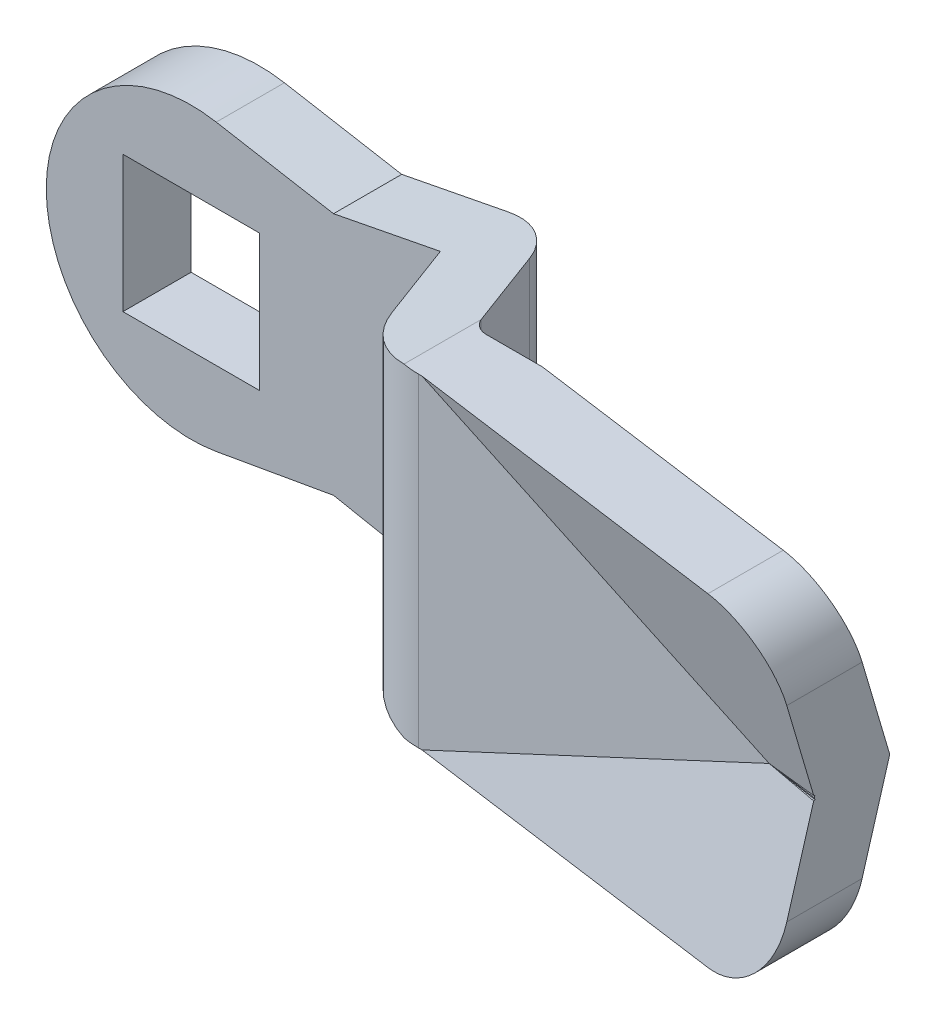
ISO-10303-21;
HEADER;
FILE_DESCRIPTION(('STEP AP214'),'2;1');
FILE_NAME('part.step','',(''),(''),'','','');
FILE_SCHEMA(('AUTOMOTIVE_DESIGN { 1 0 10303 214 1 1 1 1 }'));
ENDSEC;
DATA;
#1=APPLICATION_CONTEXT('core data for automotive mechanical design processes');
#2=APPLICATION_PROTOCOL_DEFINITION('international standard','automotive_design',2000,#1);
#3=PRODUCT_CONTEXT('',#1,'mechanical');
#4=PRODUCT('Part','Part','',(#3));
#5=PRODUCT_RELATED_PRODUCT_CATEGORY('part','',(#4));
#6=PRODUCT_DEFINITION_FORMATION('','',#4);
#7=PRODUCT_DEFINITION_CONTEXT('part definition',#1,'design');
#8=PRODUCT_DEFINITION('design','',#6,#7);
#9=PRODUCT_DEFINITION_SHAPE('','',#8);
#10=(LENGTH_UNIT() NAMED_UNIT(*) SI_UNIT(.MILLI.,.METRE.));
#11=(NAMED_UNIT(*) PLANE_ANGLE_UNIT() SI_UNIT($,.RADIAN.));
#12=(NAMED_UNIT(*) SI_UNIT($,.STERADIAN.) SOLID_ANGLE_UNIT());
#13=UNCERTAINTY_MEASURE_WITH_UNIT(LENGTH_MEASURE(1.E-05),#10,'distance_accuracy_value','');
#14=(GEOMETRIC_REPRESENTATION_CONTEXT(3) GLOBAL_UNCERTAINTY_ASSIGNED_CONTEXT((#13)) GLOBAL_UNIT_ASSIGNED_CONTEXT((#10,
#11,#12)) REPRESENTATION_CONTEXT('',''));
#15=CARTESIAN_POINT('',(0.,0.,0.));
#16=DIRECTION('',(0.,0.,1.));
#17=DIRECTION('',(1.,0.,0.));
#18=AXIS2_PLACEMENT_3D('',#15,#16,#17);
#19=CARTESIAN_POINT('',(49.9633750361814,-17.238998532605,18.1803398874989));
#20=DIRECTION('',(0.130596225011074,-0.280064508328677,-0.951056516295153));
#21=DIRECTION('',(0.,-0.959272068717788,0.282483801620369));
#22=AXIS2_PLACEMENT_3D('',#19,#20,#21);
#23=PLANE('',#22);
#24=DIRECTION('',(-0.990703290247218,0.,-0.13604040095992));
#25=VECTOR('',#24,1.);
#26=CARTESIAN_POINT('',(50.2705232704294,-9.5,15.9435575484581));
#27=LINE('',#26,#25);
#28=CARTESIAN_POINT('',(41.,-9.5,14.6705571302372));
#29=VERTEX_POINT('',#28);
#30=CARTESIAN_POINT('',(21.5518822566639,-9.5,12.));
#31=VERTEX_POINT('',#30);
#32=EDGE_CURVE('E378',#29,#31,#27,.T.);
#33=ORIENTED_EDGE('',*,*,#32,.F.);
#34=CARTESIAN_POINT('',(41.,-5.5,13.4926481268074));
#35=DIRECTION('',(0.130596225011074,-0.280064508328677,-0.951056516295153));
#36=DIRECTION('',(0.401933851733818,-0.861949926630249,0.309016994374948));
#37=AXIS2_PLACEMENT_3D('',#34,#35,#36);
#38=ELLIPSE('',#37,4.20584889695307,4.);
#39=CARTESIAN_POINT('',(45.,-5.5,14.0419161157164));
#40=VERTEX_POINT('',#39);
#41=EDGE_CURVE('E9',#29,#40,#38,.F.);
#42=ORIENTED_EDGE('',*,*,#41,.T.);
#43=DIRECTION('',(0.,0.959272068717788,-0.28248380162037));
#44=VECTOR('',#43,1.);
#45=CARTESIAN_POINT('',(45.,-17.4236857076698,17.5531703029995));
#46=LINE('',#45,#44);
#47=CARTESIAN_POINT('',(45.,-0.136162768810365,12.4623880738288));
#48=VERTEX_POINT('',#47);
#49=EDGE_CURVE('E372',#40,#48,#46,.T.);
#50=ORIENTED_EDGE('',*,*,#49,.T.);
#51=DIRECTION('',(0.987938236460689,-0.0437421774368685,0.148541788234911));
#52=VECTOR('',#51,1.);
#53=CARTESIAN_POINT('',(51.4225647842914,-0.420529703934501,13.4280549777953));
#54=LINE('',#53,#52);
#55=CARTESIAN_POINT('',(41.924698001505,0.,12.));
#56=VERTEX_POINT('',#55);
#57=EDGE_CURVE('E218',#56,#48,#54,.T.);
#58=ORIENTED_EDGE('',*,*,#57,.F.);
#59=DIRECTION('',(0.906307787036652,0.422618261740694,0.));
#60=VECTOR('',#59,1.);
#61=CARTESIAN_POINT('',(40.8120209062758,-0.518849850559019,12.));
#62=LINE('',#61,#60);
#63=EDGE_CURVE('E394',#56,#31,#62,.F.);
#64=ORIENTED_EDGE('',*,*,#63,.T.);
#65=EDGE_LOOP('',(#33,#42,#50,#58,#64));
#66=FACE_BOUND('',#65,.T.);
#67=ADVANCED_FACE('F14',(#66),#23,.F.);
#68=DIRECTION('',(-0.990703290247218,0.,-0.13604040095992));
#69=VECTOR('',#68,1.);
#70=CARTESIAN_POINT('',(50.6475627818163,0.,13.1977975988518));
#71=LINE('',#70,#69);
#72=CARTESIAN_POINT('',(45.,0.,12.4222912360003));
#73=VERTEX_POINT('',#72);
#74=EDGE_CURVE('E227',#73,#56,#71,.T.);
#75=ORIENTED_EDGE('',*,*,#74,.F.);
#76=CARTESIAN_POINT('',(45.,0.114431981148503,12.3885936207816));
#77=VERTEX_POINT('',#76);
#78=EDGE_CURVE('E234',#73,#77,#46,.T.);
#79=ORIENTED_EDGE('',*,*,#78,.T.);
#80=DIRECTION('',(0.991435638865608,0.0368913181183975,0.125277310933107));
#81=VECTOR('',#80,1.);
#82=CARTESIAN_POINT('',(41.924698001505,0.,12.));
#83=LINE('',#82,#81);
#84=EDGE_CURVE('E239',#56,#77,#83,.T.);
#85=ORIENTED_EDGE('',*,*,#84,.F.);
#86=EDGE_LOOP('',(#75,#79,#85));
#87=FACE_BOUND('',#86,.T.);
#88=ADVANCED_FACE('F536',(#87),#23,.F.);
#89=CARTESIAN_POINT('',(45.,-40.,40.));
#90=DIRECTION('',(-1.,0.,0.));
#91=DIRECTION('',(0.,1.,0.));
#92=AXIS2_PLACEMENT_3D('',#89,#90,#91);
#93=PLANE('',#92);
#94=DIRECTION('',(0.,-0.959272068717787,-0.282483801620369));
#95=VECTOR('',#94,1.);
#96=CARTESIAN_POINT('',(45.,11.3997764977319,11.3569748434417));
#97=LINE('',#96,#95);
#98=CARTESIAN_POINT('',(45.,5.5,9.61962487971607));
#99=VERTEX_POINT('',#98);
#100=CARTESIAN_POINT('',(45.,0.,8.));
#101=VERTEX_POINT('',#100);
#102=EDGE_CURVE('E374',#99,#101,#97,.T.);
#103=ORIENTED_EDGE('',*,*,#102,.F.);
#104=DIRECTION('',(0.,0.,-1.));
#105=VECTOR('',#104,1.);
#106=CARTESIAN_POINT('',(45.,5.5,40.));
#107=LINE('',#106,#105);
#108=CARTESIAN_POINT('',(45.,5.5,14.0419161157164));
#109=VERTEX_POINT('',#108);
#110=EDGE_CURVE('E458',#99,#109,#107,.F.);
#111=ORIENTED_EDGE('',*,*,#110,.T.);
#112=DIRECTION('',(0.,0.959272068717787,0.282483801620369));
#113=VECTOR('',#112,1.);
#114=CARTESIAN_POINT('',(45.,20.0272720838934,18.3198672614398));
#115=LINE('',#114,#113);
#116=CARTESIAN_POINT('',(45.,0.136162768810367,12.4623880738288));
#117=VERTEX_POINT('',#116);
#118=EDGE_CURVE('E369',#117,#109,#115,.T.);
#119=ORIENTED_EDGE('',*,*,#118,.F.);
#120=DIRECTION('',(0.,-0.28248380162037,-0.959272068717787));
#121=VECTOR('',#120,1.);
#122=CARTESIAN_POINT('',(45.,4.39552305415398,26.9265284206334));
#123=LINE('',#122,#121);
#124=EDGE_CURVE('E445',#117,#77,#123,.T.);
#125=ORIENTED_EDGE('',*,*,#124,.T.);
#126=ORIENTED_EDGE('',*,*,#78,.F.);
#127=DIRECTION('',(0.,0.959272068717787,0.28248380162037));
#128=VECTOR('',#127,1.);
#129=CARTESIAN_POINT('',(45.,-29.3351410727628,3.78375953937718));
#130=LINE('',#129,#128);
#131=CARTESIAN_POINT('',(45.,-0.114431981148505,12.3885936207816));
#132=VERTEX_POINT('',#131);
#133=EDGE_CURVE('E222',#132,#73,#130,.T.);
#134=ORIENTED_EDGE('',*,*,#133,.F.);
#135=DIRECTION('',(0.,0.282483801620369,-0.959272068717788));
#136=VECTOR('',#135,1.);
#137=CARTESIAN_POINT('',(45.,-10.7792909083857,48.6048340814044));
#138=LINE('',#137,#136);
#139=EDGE_CURVE('E212',#48,#132,#138,.T.);
#140=ORIENTED_EDGE('',*,*,#139,.F.);
#141=ORIENTED_EDGE('',*,*,#49,.F.);
#142=DIRECTION('',(0.,0.,-1.));
#143=VECTOR('',#142,1.);
#144=CARTESIAN_POINT('',(45.,-5.5,40.));
#145=LINE('',#144,#143);
#146=CARTESIAN_POINT('',(45.,-5.5,9.61962487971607));
#147=VERTEX_POINT('',#146);
#148=EDGE_CURVE('E455',#40,#147,#145,.T.);
#149=ORIENTED_EDGE('',*,*,#148,.T.);
#150=DIRECTION('',(0.,-0.959272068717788,0.28248380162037));
#151=VECTOR('',#150,1.);
#152=CARTESIAN_POINT('',(45.,-26.2800452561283,15.7388754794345));
#153=LINE('',#152,#151);
#154=EDGE_CURVE('E376',#101,#147,#153,.T.);
#155=ORIENTED_EDGE('',*,*,#154,.F.);
#156=EDGE_LOOP('',(#103,#111,#119,#125,#126,#134,#140,#141,#149,#155));
#157=FACE_BOUND('',#156,.T.);
#158=ADVANCED_FACE('F232',(#157),#93,.F.);
#159=CARTESIAN_POINT('',(41.2717168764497,1.40032254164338,16.7552825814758));
#160=DIRECTION('',(0.,0.959272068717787,-0.28248380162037));
#161=DIRECTION('',(0.,-0.28248380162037,-0.959272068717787));
#162=AXIS2_PLACEMENT_3D('',#159,#160,#161);
#163=PLANE('',#162);
#164=DIRECTION('',(0.987938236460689,0.0437421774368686,0.148541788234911));
#165=VECTOR('',#164,1.);
#166=CARTESIAN_POINT('',(42.0457266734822,0.00535869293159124,12.018197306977));
#167=LINE('',#166,#165);
#168=EDGE_CURVE('E447',#56,#117,#167,.T.);
#169=ORIENTED_EDGE('',*,*,#168,.F.);
#170=ORIENTED_EDGE('',*,*,#84,.T.);
#171=ORIENTED_EDGE('',*,*,#124,.F.);
#172=EDGE_LOOP('',(#169,#170,#171));
#173=FACE_BOUND('',#172,.T.);
#174=ADVANCED_FACE('F534',(#173),#163,.F.);
#175=CARTESIAN_POINT('',(10.5,-2.8,-2.4));
#176=DIRECTION('',(1.,0.,0.));
#177=DIRECTION('',(0.,0.,1.));
#178=AXIS2_PLACEMENT_3D('',#175,#176,#177);
#179=PLANE('',#178);
#180=DIRECTION('',(0.,0.,1.));
#181=VECTOR('',#180,1.);
#182=CARTESIAN_POINT('',(10.5,-2.8,-2.4));
#183=LINE('',#182,#181);
#184=CARTESIAN_POINT('',(10.5,-2.8,-0.400000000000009));
#185=VERTEX_POINT('',#184);
#186=CARTESIAN_POINT('',(10.5,-2.8,0.));
#187=VERTEX_POINT('',#186);
#188=EDGE_CURVE('E279',#185,#187,#183,.T.);
#189=ORIENTED_EDGE('',*,*,#188,.F.);
#190=DIRECTION('',(0.,-1.,0.));
#191=VECTOR('',#190,1.);
#192=CARTESIAN_POINT('',(10.5,9.5,-0.400000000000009));
#193=LINE('',#192,#191);
#194=CARTESIAN_POINT('',(10.5,2.8,-0.400000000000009));
#195=VERTEX_POINT('',#194);
#196=EDGE_CURVE('E245',#195,#185,#193,.T.);
#197=ORIENTED_EDGE('',*,*,#196,.F.);
#198=DIRECTION('',(0.,0.,1.));
#199=VECTOR('',#198,1.);
#200=CARTESIAN_POINT('',(10.5,2.8,-2.4));
#201=LINE('',#200,#199);
#202=CARTESIAN_POINT('',(10.5,2.8,0.));
#203=VERTEX_POINT('',#202);
#204=EDGE_CURVE('E271',#195,#203,#201,.T.);
#205=ORIENTED_EDGE('',*,*,#204,.T.);
#206=DIRECTION('',(0.,1.,0.));
#207=VECTOR('',#206,1.);
#208=CARTESIAN_POINT('',(10.5,-2.8,0.));
#209=LINE('',#208,#207);
#210=EDGE_CURVE('E252',#187,#203,#209,.T.);
#211=ORIENTED_EDGE('',*,*,#210,.F.);
#212=EDGE_LOOP('',(#189,#197,#205,#211));
#213=FACE_BOUND('',#212,.T.);
#214=ADVANCED_FACE('F795',(#213),#179,.T.);
#215=CARTESIAN_POINT('',(10.5,-2.8,-2.4));
#216=DIRECTION('',(0.,1.,0.));
#217=DIRECTION('',(1.,0.,0.));
#218=AXIS2_PLACEMENT_3D('',#215,#216,#217);
#219=PLANE('',#218);
#220=DIRECTION('',(0.707106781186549,0.,0.707106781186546));
#221=VECTOR('',#220,1.);
#222=CARTESIAN_POINT('',(8.5,-2.8,-2.4));
#223=LINE('',#222,#221);
#224=CARTESIAN_POINT('',(8.5,-2.8,-2.4));
#225=VERTEX_POINT('',#224);
#226=EDGE_CURVE('E242',#225,#185,#223,.T.);
#227=ORIENTED_EDGE('',*,*,#226,.T.);
#228=ORIENTED_EDGE('',*,*,#188,.T.);
#229=DIRECTION('',(-1.,0.,0.));
#230=VECTOR('',#229,1.);
#231=CARTESIAN_POINT('',(10.5,-2.8,0.));
#232=LINE('',#231,#230);
#233=CARTESIAN_POINT('',(6.5,-2.8,0.));
#234=VERTEX_POINT('',#233);
#235=EDGE_CURVE('E260',#187,#234,#232,.T.);
#236=ORIENTED_EDGE('',*,*,#235,.T.);
#237=DIRECTION('',(0.,0.,1.));
#238=VECTOR('',#237,1.);
#239=CARTESIAN_POINT('',(6.5,-2.8,-2.4));
#240=LINE('',#239,#238);
#241=CARTESIAN_POINT('',(6.5,-2.8,-2.4));
#242=VERTEX_POINT('',#241);
#243=EDGE_CURVE('E276',#242,#234,#240,.T.);
#244=ORIENTED_EDGE('',*,*,#243,.F.);
#245=DIRECTION('',(-1.,0.,0.));
#246=VECTOR('',#245,1.);
#247=CARTESIAN_POINT('',(10.5,-2.8,-2.4));
#248=LINE('',#247,#246);
#249=EDGE_CURVE('E269',#225,#242,#248,.T.);
#250=ORIENTED_EDGE('',*,*,#249,.F.);
#251=EDGE_LOOP('',(#227,#228,#236,#244,#250));
#252=FACE_BOUND('',#251,.T.);
#253=ADVANCED_FACE('F785',(#252),#219,.F.);
#254=CARTESIAN_POINT('',(6.5,2.8,-2.4));
#255=DIRECTION('',(0.,-1.,0.));
#256=DIRECTION('',(-1.,0.,0.));
#257=AXIS2_PLACEMENT_3D('',#254,#255,#256);
#258=PLANE('',#257);
#259=DIRECTION('',(0.707106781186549,0.,0.707106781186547));
#260=VECTOR('',#259,1.);
#261=CARTESIAN_POINT('',(7.5,2.8,-3.4));
#262=LINE('',#261,#260);
#263=CARTESIAN_POINT('',(8.5,2.8,-2.4));
#264=VERTEX_POINT('',#263);
#265=EDGE_CURVE('E250',#264,#195,#262,.T.);
#266=ORIENTED_EDGE('',*,*,#265,.F.);
#267=DIRECTION('',(1.,0.,0.));
#268=VECTOR('',#267,1.);
#269=CARTESIAN_POINT('',(6.5,2.8,-2.4));
#270=LINE('',#269,#268);
#271=CARTESIAN_POINT('',(6.5,2.8,-2.4));
#272=VERTEX_POINT('',#271);
#273=EDGE_CURVE('E263',#272,#264,#270,.T.);
#274=ORIENTED_EDGE('',*,*,#273,.F.);
#275=DIRECTION('',(0.,0.,1.));
#276=VECTOR('',#275,1.);
#277=CARTESIAN_POINT('',(6.5,2.8,-2.4));
#278=LINE('',#277,#276);
#279=CARTESIAN_POINT('',(6.5,2.8,0.));
#280=VERTEX_POINT('',#279);
#281=EDGE_CURVE('E273',#272,#280,#278,.T.);
#282=ORIENTED_EDGE('',*,*,#281,.T.);
#283=DIRECTION('',(1.,0.,0.));
#284=VECTOR('',#283,1.);
#285=CARTESIAN_POINT('',(6.5,2.8,0.));
#286=LINE('',#285,#284);
#287=EDGE_CURVE('E255',#280,#203,#286,.T.);
#288=ORIENTED_EDGE('',*,*,#287,.T.);
#289=ORIENTED_EDGE('',*,*,#204,.F.);
#290=EDGE_LOOP('',(#266,#274,#282,#288,#289));
#291=FACE_BOUND('',#290,.T.);
#292=ADVANCED_FACE('F774',(#291),#258,.F.);
#293=CARTESIAN_POINT('',(10.5,2.8,-2.4));
#294=DIRECTION('',(0.,0.,-1.));
#295=DIRECTION('',(1.,0.,0.));
#296=AXIS2_PLACEMENT_3D('',#293,#294,#295);
#297=PLANE('',#296);
#298=ORIENTED_EDGE('',*,*,#273,.T.);
#299=DIRECTION('',(0.,-1.,0.));
#300=VECTOR('',#299,1.);
#301=CARTESIAN_POINT('',(8.5,9.5,-2.4));
#302=LINE('',#301,#300);
#303=EDGE_CURVE('E247',#264,#225,#302,.T.);
#304=ORIENTED_EDGE('',*,*,#303,.T.);
#305=ORIENTED_EDGE('',*,*,#249,.T.);
#306=DIRECTION('',(0.,-1.,0.));
#307=VECTOR('',#306,1.);
#308=CARTESIAN_POINT('',(6.5,2.8,-2.4));
#309=LINE('',#308,#307);
#310=EDGE_CURVE('E266',#272,#242,#309,.T.);
#311=ORIENTED_EDGE('',*,*,#310,.F.);
#312=EDGE_LOOP('',(#298,#304,#305,#311));
#313=FACE_BOUND('',#312,.T.);
#314=ADVANCED_FACE('F565',(#313),#297,.T.);
#315=CARTESIAN_POINT('',(14.6266592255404,-9.5,0.));
#316=DIRECTION('',(0.,0.,-1.));
#317=DIRECTION('',(1.,0.,0.));
#318=AXIS2_PLACEMENT_3D('',#315,#316,#317);
#319=PLANE('',#318);
#320=DIRECTION('',(0.,1.,0.));
#321=VECTOR('',#320,1.);
#322=CARTESIAN_POINT('',(14.6266592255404,-9.5,0.));
#323=LINE('',#322,#321);
#324=CARTESIAN_POINT('',(14.6266592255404,-8.37556405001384,0.));
#325=VERTEX_POINT('',#324);
#326=CARTESIAN_POINT('',(14.6266592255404,8.37556405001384,0.));
#327=VERTEX_POINT('',#326);
#328=EDGE_CURVE('E426',#325,#327,#323,.T.);
#329=ORIENTED_EDGE('',*,*,#328,.F.);
#330=DIRECTION('',(-0.981627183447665,0.19080899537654,0.));
#331=VECTOR('',#330,1.);
#332=CARTESIAN_POINT('',(14.8372697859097,-8.4165025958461,0.));
#333=LINE('',#332,#331);
#334=CARTESIAN_POINT('',(8.35887714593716,-7.15723063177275,0.));
#335=VERTEX_POINT('',#334);
#336=EDGE_CURVE('E319',#325,#335,#333,.T.);
#337=ORIENTED_EDGE('',*,*,#336,.T.);
#338=DIRECTION('',(0.984807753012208,0.173648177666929,0.));
#339=VECTOR('',#338,1.);
#340=CARTESIAN_POINT('',(14.0370253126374,-6.1560199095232,0.));
#341=LINE('',#340,#339);
#342=CARTESIAN_POINT('',(1.47600951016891,-8.37086590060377,0.));
#343=VERTEX_POINT('',#342);
#344=EDGE_CURVE('E443',#343,#335,#341,.T.);
#345=ORIENTED_EDGE('',*,*,#344,.F.);
#346=CARTESIAN_POINT('',(0.,0.,0.));
#347=DIRECTION('',(0.,0.,-1.));
#348=DIRECTION('',(1.,0.,0.));
#349=AXIS2_PLACEMENT_3D('',#346,#347,#348);
#350=CIRCLE('',#349,8.5);
#351=CARTESIAN_POINT('',(1.47600951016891,8.37086590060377,0.));
#352=VERTEX_POINT('',#351);
#353=EDGE_CURVE('E328',#343,#352,#350,.T.);
#354=ORIENTED_EDGE('',*,*,#353,.T.);
#355=DIRECTION('',(0.984807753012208,-0.173648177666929,0.));
#356=VECTOR('',#355,1.);
#357=CARTESIAN_POINT('',(17.2862166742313,5.58309980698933,0.));
#358=LINE('',#357,#356);
#359=CARTESIAN_POINT('',(8.35887714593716,7.15723063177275,0.));
#360=VERTEX_POINT('',#359);
#361=EDGE_CURVE('E440',#352,#360,#358,.T.);
#362=ORIENTED_EDGE('',*,*,#361,.T.);
#363=DIRECTION('',(-0.981627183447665,-0.19080899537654,0.));
#364=VECTOR('',#363,1.);
#365=CARTESIAN_POINT('',(11.2785071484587,7.72474921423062,0.));
#366=LINE('',#365,#364);
#367=EDGE_CURVE('E302',#327,#360,#366,.T.);
#368=ORIENTED_EDGE('',*,*,#367,.F.);
#369=EDGE_LOOP('',(#329,#337,#345,#354,#362,#368));
#370=FACE_BOUND('',#369,.T.);
#371=DIRECTION('',(1.,0.,0.));
#372=VECTOR('',#371,1.);
#373=CARTESIAN_POINT('',(-4.,4.,0.));
#374=LINE('',#373,#372);
#375=CARTESIAN_POINT('',(-4.,4.,0.));
#376=VERTEX_POINT('',#375);
#377=CARTESIAN_POINT('',(4.,4.,0.));
#378=VERTEX_POINT('',#377);
#379=EDGE_CURVE('E346',#376,#378,#374,.T.);
#380=ORIENTED_EDGE('',*,*,#379,.F.);
#381=DIRECTION('',(0.,-1.,0.));
#382=VECTOR('',#381,1.);
#383=CARTESIAN_POINT('',(-4.,4.,0.));
#384=LINE('',#383,#382);
#385=CARTESIAN_POINT('',(-4.,-4.,0.));
#386=VERTEX_POINT('',#385);
#387=EDGE_CURVE('E337',#376,#386,#384,.T.);
#388=ORIENTED_EDGE('',*,*,#387,.T.);
#389=DIRECTION('',(-1.,0.,0.));
#390=VECTOR('',#389,1.);
#391=CARTESIAN_POINT('',(4.,-4.,0.));
#392=LINE('',#391,#390);
#393=CARTESIAN_POINT('',(4.,-4.,0.));
#394=VERTEX_POINT('',#393);
#395=EDGE_CURVE('E340',#394,#386,#392,.T.);
#396=ORIENTED_EDGE('',*,*,#395,.F.);
#397=DIRECTION('',(0.,1.,0.));
#398=VECTOR('',#397,1.);
#399=CARTESIAN_POINT('',(4.,-4.,0.));
#400=LINE('',#399,#398);
#401=EDGE_CURVE('E343',#394,#378,#400,.T.);
#402=ORIENTED_EDGE('',*,*,#401,.T.);
#403=EDGE_LOOP('',(#380,#388,#396,#402));
#404=FACE_BOUND('',#403,.T.);
#405=ORIENTED_EDGE('',*,*,#235,.F.);
#406=ORIENTED_EDGE('',*,*,#210,.T.);
#407=ORIENTED_EDGE('',*,*,#287,.F.);
#408=DIRECTION('',(0.,-1.,0.));
#409=VECTOR('',#408,1.);
#410=CARTESIAN_POINT('',(6.5,2.8,0.));
#411=LINE('',#410,#409);
#412=EDGE_CURVE('E258',#280,#234,#411,.T.);
#413=ORIENTED_EDGE('',*,*,#412,.T.);
#414=EDGE_LOOP('',(#405,#406,#407,#413));
#415=FACE_BOUND('',#414,.T.);
#416=ADVANCED_FACE('F505',(#370,#404,#415),#319,.T.);
#417=CARTESIAN_POINT('',(14.6266592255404,-9.5,4.));
#418=DIRECTION('',(0.,0.,-1.));
#419=DIRECTION('',(1.,0.,0.));
#420=AXIS2_PLACEMENT_3D('',#417,#418,#419);
#421=PLANE('',#420);
#422=DIRECTION('',(0.,-1.,0.));
#423=VECTOR('',#422,1.);
#424=CARTESIAN_POINT('',(-4.,-9.5,4.));
#425=LINE('',#424,#423);
#426=CARTESIAN_POINT('',(-4.,4.,4.));
#427=VERTEX_POINT('',#426);
#428=CARTESIAN_POINT('',(-4.,-4.,4.));
#429=VERTEX_POINT('',#428);
#430=EDGE_CURVE('E367',#427,#429,#425,.T.);
#431=ORIENTED_EDGE('',*,*,#430,.F.);
#432=DIRECTION('',(1.,0.,0.));
#433=VECTOR('',#432,1.);
#434=CARTESIAN_POINT('',(14.6266592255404,4.,4.));
#435=LINE('',#434,#433);
#436=CARTESIAN_POINT('',(4.,4.,4.));
#437=VERTEX_POINT('',#436);
#438=EDGE_CURVE('E358',#427,#437,#435,.T.);
#439=ORIENTED_EDGE('',*,*,#438,.T.);
#440=DIRECTION('',(0.,1.,0.));
#441=VECTOR('',#440,1.);
#442=CARTESIAN_POINT('',(4.,-9.5,4.));
#443=LINE('',#442,#441);
#444=CARTESIAN_POINT('',(4.,-4.,4.));
#445=VERTEX_POINT('',#444);
#446=EDGE_CURVE('E361',#445,#437,#443,.T.);
#447=ORIENTED_EDGE('',*,*,#446,.F.);
#448=DIRECTION('',(-1.,0.,0.));
#449=VECTOR('',#448,1.);
#450=CARTESIAN_POINT('',(14.6266592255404,-4.,4.));
#451=LINE('',#450,#449);
#452=EDGE_CURVE('E364',#445,#429,#451,.T.);
#453=ORIENTED_EDGE('',*,*,#452,.T.);
#454=EDGE_LOOP('',(#431,#439,#447,#453));
#455=FACE_BOUND('',#454,.T.);
#456=DIRECTION('',(-0.981627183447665,0.19080899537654,0.));
#457=VECTOR('',#456,1.);
#458=CARTESIAN_POINT('',(14.8372697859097,-8.4165025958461,4.));
#459=LINE('',#458,#457);
#460=CARTESIAN_POINT('',(14.6266592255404,-8.37556405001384,4.));
#461=VERTEX_POINT('',#460);
#462=CARTESIAN_POINT('',(8.35887714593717,-7.15723063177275,4.));
#463=VERTEX_POINT('',#462);
#464=EDGE_CURVE('E326',#461,#463,#459,.T.);
#465=ORIENTED_EDGE('',*,*,#464,.F.);
#466=DIRECTION('',(0.,1.,0.));
#467=VECTOR('',#466,1.);
#468=CARTESIAN_POINT('',(14.6266592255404,-9.5,4.));
#469=LINE('',#468,#467);
#470=CARTESIAN_POINT('',(14.6266592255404,8.37556405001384,4.));
#471=VERTEX_POINT('',#470);
#472=EDGE_CURVE('E429',#461,#471,#469,.T.);
#473=ORIENTED_EDGE('',*,*,#472,.T.);
#474=DIRECTION('',(-0.981627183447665,-0.19080899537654,0.));
#475=VECTOR('',#474,1.);
#476=CARTESIAN_POINT('',(11.2785071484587,7.72474921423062,4.));
#477=LINE('',#476,#475);
#478=CARTESIAN_POINT('',(8.35887714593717,7.15723063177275,4.));
#479=VERTEX_POINT('',#478);
#480=EDGE_CURVE('E310',#471,#479,#477,.T.);
#481=ORIENTED_EDGE('',*,*,#480,.T.);
#482=DIRECTION('',(0.984807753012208,-0.173648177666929,0.));
#483=VECTOR('',#482,1.);
#484=CARTESIAN_POINT('',(17.2862166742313,5.58309980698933,4.));
#485=LINE('',#484,#483);
#486=CARTESIAN_POINT('',(1.47600951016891,8.37086590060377,4.));
#487=VERTEX_POINT('',#486);
#488=EDGE_CURVE('E332',#487,#479,#485,.T.);
#489=ORIENTED_EDGE('',*,*,#488,.F.);
#490=CARTESIAN_POINT('',(0.,0.,4.));
#491=DIRECTION('',(0.,0.,-1.));
#492=DIRECTION('',(1.,0.,0.));
#493=AXIS2_PLACEMENT_3D('',#490,#491,#492);
#494=CIRCLE('',#493,8.5);
#495=CARTESIAN_POINT('',(1.47600951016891,-8.37086590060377,4.));
#496=VERTEX_POINT('',#495);
#497=EDGE_CURVE('E330',#496,#487,#494,.T.);
#498=ORIENTED_EDGE('',*,*,#497,.F.);
#499=DIRECTION('',(0.984807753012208,0.173648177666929,0.));
#500=VECTOR('',#499,1.);
#501=CARTESIAN_POINT('',(14.0370253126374,-6.1560199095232,4.));
#502=LINE('',#501,#500);
#503=EDGE_CURVE('E334',#496,#463,#502,.T.);
#504=ORIENTED_EDGE('',*,*,#503,.T.);
#505=EDGE_LOOP('',(#465,#473,#481,#489,#498,#504));
#506=FACE_BOUND('',#505,.T.);
#507=ADVANCED_FACE('F517',(#455,#506),#421,.F.);
#508=CARTESIAN_POINT('',(21.3318855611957,-9.5,7.));
#509=DIRECTION('',(0.,-1.,0.));
#510=DIRECTION('',(-1.,0.,0.));
#511=AXIS2_PLACEMENT_3D('',#508,#509,#510);
#512=PLANE('',#511);
#513=DIRECTION('',(0.990703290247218,0.,0.13604040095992));
#514=VECTOR('',#513,1.);
#515=CARTESIAN_POINT('',(33.3500490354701,-9.5,9.19779759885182));
#516=LINE('',#515,#514);
#517=CARTESIAN_POINT('',(24.6271842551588,-9.5,8.));
#518=VERTEX_POINT('',#517);
#519=CARTESIAN_POINT('',(41.,-9.5,10.2482658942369));
#520=VERTEX_POINT('',#519);
#521=EDGE_CURVE('E438',#518,#520,#516,.T.);
#522=ORIENTED_EDGE('',*,*,#521,.T.);
#523=DIRECTION('',(0.,0.,-1.));
#524=VECTOR('',#523,1.);
#525=CARTESIAN_POINT('',(41.,-9.5,40.));
#526=LINE('',#525,#524);
#527=EDGE_CURVE('E22',#520,#29,#526,.F.);
#528=ORIENTED_EDGE('',*,*,#527,.T.);
#529=ORIENTED_EDGE('',*,*,#32,.T.);
#530=DIRECTION('',(-1.,0.,0.));
#531=VECTOR('',#530,1.);
#532=CARTESIAN_POINT('',(45.,-9.5,12.));
#533=LINE('',#532,#531);
#534=CARTESIAN_POINT('',(21.3318855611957,-9.5,12.));
#535=VERTEX_POINT('',#534);
#536=EDGE_CURVE('E415',#31,#535,#533,.T.);
#537=ORIENTED_EDGE('',*,*,#536,.T.);
#538=CARTESIAN_POINT('',(21.3318855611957,-9.5,7.));
#539=DIRECTION('',(0.,-1.,0.));
#540=DIRECTION('',(-1.,0.,0.));
#541=AXIS2_PLACEMENT_3D('',#538,#539,#540);
#542=CIRCLE('',#541,5.);
#543=CARTESIAN_POINT('',(20.4113807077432,-9.5,11.9145366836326));
#544=VERTEX_POINT('',#543);
#545=EDGE_CURVE('E412',#535,#544,#542,.T.);
#546=ORIENTED_EDGE('',*,*,#545,.T.);
#547=DIRECTION('',(0.,0.,-1.));
#548=VECTOR('',#547,1.);
#549=CARTESIAN_POINT('',(20.4113807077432,-9.5,25.));
#550=LINE('',#549,#548);
#551=CARTESIAN_POINT('',(20.4113807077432,-9.5,7.39073112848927));
#552=VERTEX_POINT('',#551);
#553=EDGE_CURVE('E295',#544,#552,#550,.T.);
#554=ORIENTED_EDGE('',*,*,#553,.T.);
#555=CARTESIAN_POINT('',(21.3318855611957,-9.5,7.));
#556=DIRECTION('',(0.,-1.,0.));
#557=DIRECTION('',(-1.,0.,0.));
#558=AXIS2_PLACEMENT_3D('',#555,#556,#557);
#559=CIRCLE('',#558,1.);
#560=CARTESIAN_POINT('',(21.3318855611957,-9.5,8.));
#561=VERTEX_POINT('',#560);
#562=EDGE_CURVE('E409',#561,#552,#559,.T.);
#563=ORIENTED_EDGE('',*,*,#562,.F.);
#564=DIRECTION('',(-1.,0.,0.));
#565=VECTOR('',#564,1.);
#566=CARTESIAN_POINT('',(45.,-9.5,8.));
#567=LINE('',#566,#565);
#568=EDGE_CURVE('E407',#518,#561,#567,.T.);
#569=ORIENTED_EDGE('',*,*,#568,.F.);
#570=EDGE_LOOP('',(#522,#528,#529,#537,#546,#554,#563,#569));
#571=FACE_BOUND('',#570,.T.);
#572=ADVANCED_FACE('F552',(#571),#512,.T.);
#573=CARTESIAN_POINT('',(21.3318855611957,-9.5,7.));
#574=DIRECTION('',(0.,1.,0.));
#575=DIRECTION('',(1.,0.,0.));
#576=AXIS2_PLACEMENT_3D('',#573,#574,#575);
#577=CYLINDRICAL_SURFACE('',#576,5.);
#578=CARTESIAN_POINT('',(21.3318855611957,-9.67892801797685,7.));
#579=DIRECTION('',(-0.19080899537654,-0.981627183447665,0.));
#580=DIRECTION('',(-0.981627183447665,0.19080899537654,0.));
#581=AXIS2_PLACEMENT_3D('',#578,#579,#580);
#582=ELLIPSE('',#581,5.09358347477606,5.);
#583=CARTESIAN_POINT('',(16.7293612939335,-8.7842879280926,8.95365564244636));
#584=VERTEX_POINT('',#583);
#585=EDGE_CURVE('E324',#544,#584,#582,.T.);
#586=ORIENTED_EDGE('',*,*,#585,.F.);
#587=ORIENTED_EDGE('',*,*,#545,.F.);
#588=DIRECTION('',(0.,1.,0.));
#589=VECTOR('',#588,1.);
#590=CARTESIAN_POINT('',(21.3318855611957,-9.5,12.));
#591=LINE('',#590,#589);
#592=CARTESIAN_POINT('',(21.3318855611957,9.5,12.));
#593=VERTEX_POINT('',#592);
#594=EDGE_CURVE('E435',#535,#593,#591,.T.);
#595=ORIENTED_EDGE('',*,*,#594,.T.);
#596=CARTESIAN_POINT('',(21.3318855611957,9.5,7.));
#597=DIRECTION('',(0.,-1.,0.));
#598=DIRECTION('',(-1.,0.,0.));
#599=AXIS2_PLACEMENT_3D('',#596,#597,#598);
#600=CIRCLE('',#599,5.);
#601=CARTESIAN_POINT('',(20.4113807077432,9.5,11.9145366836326));
#602=VERTEX_POINT('',#601);
#603=EDGE_CURVE('E402',#593,#602,#600,.T.);
#604=ORIENTED_EDGE('',*,*,#603,.T.);
#605=CARTESIAN_POINT('',(21.3318855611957,9.67892801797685,7.));
#606=DIRECTION('',(0.19080899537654,-0.981627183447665,0.));
#607=DIRECTION('',(0.981627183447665,0.19080899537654,0.));
#608=AXIS2_PLACEMENT_3D('',#605,#606,#607);
#609=ELLIPSE('',#608,5.09358347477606,5.);
#610=CARTESIAN_POINT('',(16.7293612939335,8.7842879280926,8.95365564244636));
#611=VERTEX_POINT('',#610);
#612=EDGE_CURVE('E307',#602,#611,#609,.T.);
#613=ORIENTED_EDGE('',*,*,#612,.T.);
#614=DIRECTION('',(0.,1.,0.));
#615=VECTOR('',#614,1.);
#616=CARTESIAN_POINT('',(16.7293612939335,-9.5,8.95365564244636));
#617=LINE('',#616,#615);
#618=EDGE_CURVE('E432',#584,#611,#617,.T.);
#619=ORIENTED_EDGE('',*,*,#618,.F.);
#620=EDGE_LOOP('',(#586,#587,#595,#604,#613,#619));
#621=FACE_BOUND('',#620,.T.);
#622=ADVANCED_FACE('F525',(#621),#577,.T.);
#623=CARTESIAN_POINT('',(16.7293612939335,-9.5,8.95365564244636));
#624=DIRECTION('',(0.920504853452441,0.,-0.390731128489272));
#625=DIRECTION('',(0.390731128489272,0.,0.920504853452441));
#626=AXIS2_PLACEMENT_3D('',#623,#624,#625);
#627=PLANE('',#626);
#628=DIRECTION('',(-0.389609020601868,0.0757323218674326,-0.91786133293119));
#629=VECTOR('',#628,1.);
#630=CARTESIAN_POINT('',(16.7504790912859,-8.78839281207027,9.00340605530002));
#631=LINE('',#630,#629);
#632=EDGE_CURVE('E322',#584,#461,#631,.T.);
#633=ORIENTED_EDGE('',*,*,#632,.F.);
#634=ORIENTED_EDGE('',*,*,#618,.T.);
#635=DIRECTION('',(-0.389609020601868,-0.0757323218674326,-0.91786133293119));
#636=VECTOR('',#635,1.);
#637=CARTESIAN_POINT('',(16.1898651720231,8.67942050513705,7.68268242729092));
#638=LINE('',#637,#636);
#639=EDGE_CURVE('E304',#611,#471,#638,.T.);
#640=ORIENTED_EDGE('',*,*,#639,.T.);
#641=ORIENTED_EDGE('',*,*,#472,.F.);
#642=EDGE_LOOP('',(#633,#634,#640,#641));
#643=FACE_BOUND('',#642,.T.);
#644=ADVANCED_FACE('F521',(#643),#627,.F.);
#645=CARTESIAN_POINT('',(14.6266592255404,-9.5,4.));
#646=DIRECTION('',(0.,1.,0.));
#647=DIRECTION('',(1.,0.,0.));
#648=AXIS2_PLACEMENT_3D('',#645,#646,#647);
#649=CYLINDRICAL_SURFACE('',#648,4.);
#650=DIRECTION('',(0.,1.,0.));
#651=VECTOR('',#650,1.);
#652=CARTESIAN_POINT('',(18.3086786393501,-9.5,2.43707548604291));
#653=LINE('',#652,#651);
#654=CARTESIAN_POINT('',(18.3086786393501,-9.09127612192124,2.43707548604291));
#655=VERTEX_POINT('',#654);
#656=CARTESIAN_POINT('',(18.3086786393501,9.09127612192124,2.43707548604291));
#657=VERTEX_POINT('',#656);
#658=EDGE_CURVE('E423',#655,#657,#653,.T.);
#659=ORIENTED_EDGE('',*,*,#658,.F.);
#660=CARTESIAN_POINT('',(14.6266592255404,-8.37556405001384,4.));
#661=DIRECTION('',(-0.19080899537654,-0.981627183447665,0.));
#662=DIRECTION('',(-0.981627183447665,0.19080899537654,0.));
#663=AXIS2_PLACEMENT_3D('',#660,#661,#662);
#664=ELLIPSE('',#663,4.07486677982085,4.);
#665=EDGE_CURVE('E316',#655,#325,#664,.F.);
#666=ORIENTED_EDGE('',*,*,#665,.T.);
#667=ORIENTED_EDGE('',*,*,#328,.T.);
#668=CARTESIAN_POINT('',(14.6266592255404,8.37556405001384,4.));
#669=DIRECTION('',(0.19080899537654,-0.981627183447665,0.));
#670=DIRECTION('',(0.981627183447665,0.19080899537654,0.));
#671=AXIS2_PLACEMENT_3D('',#668,#669,#670);
#672=ELLIPSE('',#671,4.07486677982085,4.);
#673=EDGE_CURVE('E300',#657,#327,#672,.F.);
#674=ORIENTED_EDGE('',*,*,#673,.F.);
#675=EDGE_LOOP('',(#659,#666,#667,#674));
#676=FACE_BOUND('',#675,.T.);
#677=ADVANCED_FACE('F502',(#676),#649,.T.);
#678=CARTESIAN_POINT('',(20.4113807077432,-9.5,7.39073112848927));
#679=DIRECTION('',(0.920504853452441,0.,-0.390731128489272));
#680=DIRECTION('',(0.390731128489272,0.,0.920504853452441));
#681=AXIS2_PLACEMENT_3D('',#678,#679,#680);
#682=PLANE('',#681);
#683=DIRECTION('',(0.,1.,0.));
#684=VECTOR('',#683,1.);
#685=CARTESIAN_POINT('',(20.4113807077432,-9.5,7.39073112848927));
#686=LINE('',#685,#684);
#687=CARTESIAN_POINT('',(20.4113807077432,9.5,7.39073112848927));
#688=VERTEX_POINT('',#687);
#689=EDGE_CURVE('E420',#552,#688,#686,.T.);
#690=ORIENTED_EDGE('',*,*,#689,.F.);
#691=DIRECTION('',(-0.389609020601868,0.0757323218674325,-0.91786133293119));
#692=VECTOR('',#691,1.);
#693=CARTESIAN_POINT('',(20.4113807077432,-9.5,7.39073112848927));
#694=LINE('',#693,#692);
#695=EDGE_CURVE('E313',#552,#655,#694,.T.);
#696=ORIENTED_EDGE('',*,*,#695,.T.);
#697=ORIENTED_EDGE('',*,*,#658,.T.);
#698=DIRECTION('',(-0.389609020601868,-0.0757323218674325,-0.91786133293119));
#699=VECTOR('',#698,1.);
#700=CARTESIAN_POINT('',(19.8507667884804,9.39102769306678,6.07000750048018));
#701=LINE('',#700,#699);
#702=EDGE_CURVE('E298',#688,#657,#701,.T.);
#703=ORIENTED_EDGE('',*,*,#702,.F.);
#704=EDGE_LOOP('',(#690,#696,#697,#703));
#705=FACE_BOUND('',#704,.T.);
#706=ADVANCED_FACE('F495',(#705),#682,.T.);
#707=CARTESIAN_POINT('',(32.6658612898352,-26.7389985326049,14.180339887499));
#708=DIRECTION('',(-0.130596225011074,0.280064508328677,0.951056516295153));
#709=DIRECTION('',(0.,0.959272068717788,-0.282483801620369));
#710=AXIS2_PLACEMENT_3D('',#707,#708,#709);
#711=PLANE('',#710);
#712=ORIENTED_EDGE('',*,*,#154,.T.);
#713=CARTESIAN_POINT('',(41.,-5.5,9.07035689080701));
#714=DIRECTION('',(-0.130596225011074,0.280064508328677,0.951056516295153));
#715=DIRECTION('',(0.401933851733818,-0.861949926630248,0.309016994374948));
#716=AXIS2_PLACEMENT_3D('',#713,#714,#715);
#717=ELLIPSE('',#716,4.20584889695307,4.);
#718=EDGE_CURVE('E36',#147,#520,#717,.F.);
#719=ORIENTED_EDGE('',*,*,#718,.T.);
#720=ORIENTED_EDGE('',*,*,#521,.F.);
#721=DIRECTION('',(-0.906307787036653,-0.422618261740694,0.));
#722=VECTOR('',#721,1.);
#723=CARTESIAN_POINT('',(45.,0.,8.));
#724=LINE('',#723,#722);
#725=EDGE_CURVE('E388',#101,#518,#724,.T.);
#726=ORIENTED_EDGE('',*,*,#725,.F.);
#727=EDGE_LOOP('',(#712,#719,#720,#726));
#728=FACE_BOUND('',#727,.T.);
#729=ADVANCED_FACE('F481',(#728),#711,.F.);
#730=CARTESIAN_POINT('',(45.,-9.5,8.));
#731=DIRECTION('',(0.,0.,-1.));
#732=DIRECTION('',(0.,-1.,0.));
#733=AXIS2_PLACEMENT_3D('',#730,#731,#732);
#734=PLANE('',#733);
#735=DIRECTION('',(-0.906307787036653,0.422618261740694,0.));
#736=VECTOR('',#735,1.);
#737=CARTESIAN_POINT('',(45.,0.,8.));
#738=LINE('',#737,#736);
#739=CARTESIAN_POINT('',(24.6271842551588,9.5,8.));
#740=VERTEX_POINT('',#739);
#741=EDGE_CURVE('E385',#101,#740,#738,.T.);
#742=ORIENTED_EDGE('',*,*,#741,.F.);
#743=ORIENTED_EDGE('',*,*,#725,.T.);
#744=ORIENTED_EDGE('',*,*,#568,.T.);
#745=DIRECTION('',(0.,1.,0.));
#746=VECTOR('',#745,1.);
#747=CARTESIAN_POINT('',(21.3318855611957,-9.5,8.));
#748=LINE('',#747,#746);
#749=CARTESIAN_POINT('',(21.3318855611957,9.5,8.));
#750=VERTEX_POINT('',#749);
#751=EDGE_CURVE('E417',#561,#750,#748,.T.);
#752=ORIENTED_EDGE('',*,*,#751,.T.);
#753=DIRECTION('',(-1.,0.,0.));
#754=VECTOR('',#753,1.);
#755=CARTESIAN_POINT('',(45.,9.5,8.));
#756=LINE('',#755,#754);
#757=EDGE_CURVE('E397',#740,#750,#756,.T.);
#758=ORIENTED_EDGE('',*,*,#757,.F.);
#759=EDGE_LOOP('',(#742,#743,#744,#752,#758));
#760=FACE_BOUND('',#759,.T.);
#761=ADVANCED_FACE('F485',(#760),#734,.T.);
#762=CARTESIAN_POINT('',(45.,-9.5,12.));
#763=DIRECTION('',(0.,0.,-1.));
#764=DIRECTION('',(0.,-1.,0.));
#765=AXIS2_PLACEMENT_3D('',#762,#763,#764);
#766=PLANE('',#765);
#767=ORIENTED_EDGE('',*,*,#63,.F.);
#768=DIRECTION('',(-0.906307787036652,0.422618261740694,0.));
#769=VECTOR('',#768,1.);
#770=CARTESIAN_POINT('',(48.089443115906,-2.87466785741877,12.));
#771=LINE('',#770,#769);
#772=CARTESIAN_POINT('',(21.5518822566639,9.5,12.));
#773=VERTEX_POINT('',#772);
#774=EDGE_CURVE('E391',#56,#773,#771,.T.);
#775=ORIENTED_EDGE('',*,*,#774,.T.);
#776=DIRECTION('',(-1.,0.,0.));
#777=VECTOR('',#776,1.);
#778=CARTESIAN_POINT('',(45.,9.5,12.));
#779=LINE('',#778,#777);
#780=EDGE_CURVE('E405',#773,#593,#779,.T.);
#781=ORIENTED_EDGE('',*,*,#780,.T.);
#782=ORIENTED_EDGE('',*,*,#594,.F.);
#783=ORIENTED_EDGE('',*,*,#536,.F.);
#784=EDGE_LOOP('',(#767,#775,#781,#782,#783));
#785=FACE_BOUND('',#784,.T.);
#786=ADVANCED_FACE('F16',(#785),#766,.F.);
#787=CARTESIAN_POINT('',(21.3318855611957,-9.5,7.));
#788=DIRECTION('',(0.,1.,0.));
#789=DIRECTION('',(1.,0.,0.));
#790=AXIS2_PLACEMENT_3D('',#787,#788,#789);
#791=CYLINDRICAL_SURFACE('',#790,1.);
#792=ORIENTED_EDGE('',*,*,#751,.F.);
#793=ORIENTED_EDGE('',*,*,#562,.T.);
#794=ORIENTED_EDGE('',*,*,#689,.T.);
#795=CARTESIAN_POINT('',(21.3318855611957,9.5,7.));
#796=DIRECTION('',(0.,-1.,0.));
#797=DIRECTION('',(-1.,0.,0.));
#798=AXIS2_PLACEMENT_3D('',#795,#796,#797);
#799=CIRCLE('',#798,1.);
#800=EDGE_CURVE('E399',#750,#688,#799,.T.);
#801=ORIENTED_EDGE('',*,*,#800,.F.);
#802=EDGE_LOOP('',(#792,#793,#794,#801));
#803=FACE_BOUND('',#802,.T.);
#804=ADVANCED_FACE('F490',(#803),#791,.F.);
#805=CARTESIAN_POINT('',(21.3318855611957,9.5,7.));
#806=DIRECTION('',(0.,-1.,0.));
#807=DIRECTION('',(-1.,0.,0.));
#808=AXIS2_PLACEMENT_3D('',#805,#806,#807);
#809=PLANE('',#808);
#810=DIRECTION('',(-0.990703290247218,0.,-0.13604040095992));
#811=VECTOR('',#810,1.);
#812=CARTESIAN_POINT('',(27.2217443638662,9.5,12.7785684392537));
#813=LINE('',#812,#811);
#814=CARTESIAN_POINT('',(41.,9.5,14.6705571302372));
#815=VERTEX_POINT('',#814);
#816=EDGE_CURVE('E383',#815,#773,#813,.T.);
#817=ORIENTED_EDGE('',*,*,#816,.F.);
#818=DIRECTION('',(0.,0.,-1.));
#819=VECTOR('',#818,1.);
#820=CARTESIAN_POINT('',(41.,9.5,7.));
#821=LINE('',#820,#819);
#822=CARTESIAN_POINT('',(41.,9.5,10.2482658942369));
#823=VERTEX_POINT('',#822);
#824=EDGE_CURVE('E450',#815,#823,#821,.T.);
#825=ORIENTED_EDGE('',*,*,#824,.T.);
#826=DIRECTION('',(0.990703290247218,0.,0.13604040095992));
#827=VECTOR('',#826,1.);
#828=CARTESIAN_POINT('',(50.2928225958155,9.5,11.5243283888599));
#829=LINE('',#828,#827);
#830=EDGE_CURVE('E380',#740,#823,#829,.T.);
#831=ORIENTED_EDGE('',*,*,#830,.F.);
#832=ORIENTED_EDGE('',*,*,#757,.T.);
#833=ORIENTED_EDGE('',*,*,#800,.T.);
#834=DIRECTION('',(0.,0.,-1.));
#835=VECTOR('',#834,1.);
#836=CARTESIAN_POINT('',(20.4113807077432,9.5,25.));
#837=LINE('',#836,#835);
#838=EDGE_CURVE('E281',#602,#688,#837,.T.);
#839=ORIENTED_EDGE('',*,*,#838,.F.);
#840=ORIENTED_EDGE('',*,*,#603,.F.);
#841=ORIENTED_EDGE('',*,*,#780,.F.);
#842=EDGE_LOOP('',(#817,#825,#831,#832,#833,#839,#840,#841));
#843=FACE_BOUND('',#842,.T.);
#844=ADVANCED_FACE('F472',(#843),#809,.F.);
#845=CARTESIAN_POINT('',(26.7770223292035,20.7053490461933,16.0172209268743));
#846=DIRECTION('',(0.130596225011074,0.280064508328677,-0.951056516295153));
#847=DIRECTION('',(0.,-0.959272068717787,-0.282483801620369));
#848=AXIS2_PLACEMENT_3D('',#845,#846,#847);
#849=PLANE('',#848);
#850=ORIENTED_EDGE('',*,*,#118,.T.);
#851=CARTESIAN_POINT('',(41.,5.5,13.4926481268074));
#852=DIRECTION('',(0.130596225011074,0.280064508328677,-0.951056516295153));
#853=DIRECTION('',(-0.401933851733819,-0.861949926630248,-0.309016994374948));
#854=AXIS2_PLACEMENT_3D('',#851,#852,#853);
#855=ELLIPSE('',#854,4.20584889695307,4.);
#856=EDGE_CURVE('E460',#109,#815,#855,.F.);
#857=ORIENTED_EDGE('',*,*,#856,.T.);
#858=ORIENTED_EDGE('',*,*,#816,.T.);
#859=ORIENTED_EDGE('',*,*,#774,.F.);
#860=ORIENTED_EDGE('',*,*,#168,.T.);
#861=EDGE_LOOP('',(#850,#857,#858,#859,#860));
#862=FACE_BOUND('',#861,.T.);
#863=ADVANCED_FACE('F465',(#862),#849,.F.);
#864=CARTESIAN_POINT('',(50.2251400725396,11.2053490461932,12.0172209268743));
#865=DIRECTION('',(-0.130596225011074,-0.280064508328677,0.951056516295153));
#866=DIRECTION('',(0.,0.959272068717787,0.282483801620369));
#867=AXIS2_PLACEMENT_3D('',#864,#865,#866);
#868=PLANE('',#867);
#869=ORIENTED_EDGE('',*,*,#830,.T.);
#870=CARTESIAN_POINT('',(41.,5.5,9.07035689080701));
#871=DIRECTION('',(-0.130596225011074,-0.280064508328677,0.951056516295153));
#872=DIRECTION('',(-0.401933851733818,-0.861949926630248,-0.309016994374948));
#873=AXIS2_PLACEMENT_3D('',#870,#871,#872);
#874=ELLIPSE('',#873,4.20584889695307,4.);
#875=EDGE_CURVE('E453',#823,#99,#874,.F.);
#876=ORIENTED_EDGE('',*,*,#875,.T.);
#877=ORIENTED_EDGE('',*,*,#102,.T.);
#878=ORIENTED_EDGE('',*,*,#741,.T.);
#879=EDGE_LOOP('',(#869,#876,#877,#878));
#880=FACE_BOUND('',#879,.T.);
#881=ADVANCED_FACE('F476',(#880),#868,.F.);
#882=CARTESIAN_POINT('',(-4.,4.,15.2198251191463));
#883=DIRECTION('',(1.,0.,0.));
#884=DIRECTION('',(0.,0.,1.));
#885=AXIS2_PLACEMENT_3D('',#882,#883,#884);
#886=PLANE('',#885);
#887=ORIENTED_EDGE('',*,*,#430,.T.);
#888=DIRECTION('',(0.,0.,-1.));
#889=VECTOR('',#888,1.);
#890=CARTESIAN_POINT('',(-4.,-4.,15.2198251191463));
#891=LINE('',#890,#889);
#892=EDGE_CURVE('E356',#429,#386,#891,.T.);
#893=ORIENTED_EDGE('',*,*,#892,.T.);
#894=ORIENTED_EDGE('',*,*,#387,.F.);
#895=DIRECTION('',(0.,0.,-1.));
#896=VECTOR('',#895,1.);
#897=CARTESIAN_POINT('',(-4.,4.,15.2198251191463));
#898=LINE('',#897,#896);
#899=EDGE_CURVE('E349',#427,#376,#898,.T.);
#900=ORIENTED_EDGE('',*,*,#899,.F.);
#901=EDGE_LOOP('',(#887,#893,#894,#900));
#902=FACE_BOUND('',#901,.T.);
#903=ADVANCED_FACE('F639',(#902),#886,.T.);
#904=CARTESIAN_POINT('',(4.,-4.,15.2198251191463));
#905=DIRECTION('',(0.,-1.,0.));
#906=DIRECTION('',(-1.,0.,0.));
#907=AXIS2_PLACEMENT_3D('',#904,#905,#906);
#908=PLANE('',#907);
#909=DIRECTION('',(0.,0.,-1.));
#910=VECTOR('',#909,1.);
#911=CARTESIAN_POINT('',(4.,-4.,15.2198251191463));
#912=LINE('',#911,#910);
#913=EDGE_CURVE('E354',#445,#394,#912,.T.);
#914=ORIENTED_EDGE('',*,*,#913,.T.);
#915=ORIENTED_EDGE('',*,*,#395,.T.);
#916=ORIENTED_EDGE('',*,*,#892,.F.);
#917=ORIENTED_EDGE('',*,*,#452,.F.);
#918=EDGE_LOOP('',(#914,#915,#916,#917));
#919=FACE_BOUND('',#918,.T.);
#920=ADVANCED_FACE('F646',(#919),#908,.F.);
#921=CARTESIAN_POINT('',(4.,-4.,15.2198251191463));
#922=DIRECTION('',(-1.,0.,0.));
#923=DIRECTION('',(0.,0.,-1.));
#924=AXIS2_PLACEMENT_3D('',#921,#922,#923);
#925=PLANE('',#924);
#926=ORIENTED_EDGE('',*,*,#446,.T.);
#927=DIRECTION('',(0.,0.,-1.));
#928=VECTOR('',#927,1.);
#929=CARTESIAN_POINT('',(4.,4.,15.2198251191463));
#930=LINE('',#929,#928);
#931=EDGE_CURVE('E352',#437,#378,#930,.T.);
#932=ORIENTED_EDGE('',*,*,#931,.T.);
#933=ORIENTED_EDGE('',*,*,#401,.F.);
#934=ORIENTED_EDGE('',*,*,#913,.F.);
#935=EDGE_LOOP('',(#926,#932,#933,#934));
#936=FACE_BOUND('',#935,.T.);
#937=ADVANCED_FACE('F655',(#936),#925,.T.);
#938=CARTESIAN_POINT('',(-4.,4.,15.2198251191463));
#939=DIRECTION('',(0.,1.,0.));
#940=DIRECTION('',(1.,0.,0.));
#941=AXIS2_PLACEMENT_3D('',#938,#939,#940);
#942=PLANE('',#941);
#943=ORIENTED_EDGE('',*,*,#899,.T.);
#944=ORIENTED_EDGE('',*,*,#379,.T.);
#945=ORIENTED_EDGE('',*,*,#931,.F.);
#946=ORIENTED_EDGE('',*,*,#438,.F.);
#947=EDGE_LOOP('',(#943,#944,#945,#946));
#948=FACE_BOUND('',#947,.T.);
#949=ADVANCED_FACE('F664',(#948),#942,.F.);
#950=CARTESIAN_POINT('',(1.47600951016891,-8.37086590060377,25.));
#951=DIRECTION('',(-0.173648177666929,0.984807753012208,0.));
#952=DIRECTION('',(0.984807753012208,0.173648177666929,0.));
#953=AXIS2_PLACEMENT_3D('',#950,#951,#952);
#954=PLANE('',#953);
#955=DIRECTION('',(0.,0.,-1.));
#956=VECTOR('',#955,1.);
#957=CARTESIAN_POINT('',(1.47600951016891,-8.37086590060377,25.));
#958=LINE('',#957,#956);
#959=EDGE_CURVE('E289',#496,#343,#958,.T.);
#960=ORIENTED_EDGE('',*,*,#959,.T.);
#961=ORIENTED_EDGE('',*,*,#344,.T.);
#962=DIRECTION('',(0.,0.,-1.));
#963=VECTOR('',#962,1.);
#964=CARTESIAN_POINT('',(8.35887714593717,-7.15723063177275,25.));
#965=LINE('',#964,#963);
#966=EDGE_CURVE('E292',#463,#335,#965,.T.);
#967=ORIENTED_EDGE('',*,*,#966,.F.);
#968=ORIENTED_EDGE('',*,*,#503,.F.);
#969=EDGE_LOOP('',(#960,#961,#967,#968));
#970=FACE_BOUND('',#969,.T.);
#971=ADVANCED_FACE('F673',(#970),#954,.F.);
#972=CARTESIAN_POINT('',(1.47600951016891,8.37086590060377,25.));
#973=DIRECTION('',(0.173648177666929,0.984807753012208,0.));
#974=DIRECTION('',(0.984807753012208,-0.173648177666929,0.));
#975=AXIS2_PLACEMENT_3D('',#972,#973,#974);
#976=PLANE('',#975);
#977=ORIENTED_EDGE('',*,*,#488,.T.);
#978=DIRECTION('',(0.,0.,-1.));
#979=VECTOR('',#978,1.);
#980=CARTESIAN_POINT('',(8.35887714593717,7.15723063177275,25.));
#981=LINE('',#980,#979);
#982=EDGE_CURVE('E283',#479,#360,#981,.T.);
#983=ORIENTED_EDGE('',*,*,#982,.T.);
#984=ORIENTED_EDGE('',*,*,#361,.F.);
#985=DIRECTION('',(0.,0.,-1.));
#986=VECTOR('',#985,1.);
#987=CARTESIAN_POINT('',(1.47600951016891,8.37086590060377,25.));
#988=LINE('',#987,#986);
#989=EDGE_CURVE('E286',#487,#352,#988,.T.);
#990=ORIENTED_EDGE('',*,*,#989,.F.);
#991=EDGE_LOOP('',(#977,#983,#984,#990));
#992=FACE_BOUND('',#991,.T.);
#993=ADVANCED_FACE('F511',(#992),#976,.T.);
#994=CARTESIAN_POINT('',(0.,0.,25.));
#995=DIRECTION('',(0.,0.,-1.));
#996=DIRECTION('',(1.,0.,0.));
#997=AXIS2_PLACEMENT_3D('',#994,#995,#996);
#998=CYLINDRICAL_SURFACE('',#997,8.5);
#999=ORIENTED_EDGE('',*,*,#497,.T.);
#1000=ORIENTED_EDGE('',*,*,#989,.T.);
#1001=ORIENTED_EDGE('',*,*,#353,.F.);
#1002=ORIENTED_EDGE('',*,*,#959,.F.);
#1003=EDGE_LOOP('',(#999,#1000,#1001,#1002));
#1004=FACE_BOUND('',#1003,.T.);
#1005=ADVANCED_FACE('F690',(#1004),#998,.T.);
#1006=CARTESIAN_POINT('',(20.4113807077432,-9.5,25.));
#1007=DIRECTION('',(-0.19080899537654,-0.981627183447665,0.));
#1008=DIRECTION('',(-0.981627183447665,0.19080899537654,0.));
#1009=AXIS2_PLACEMENT_3D('',#1006,#1007,#1008);
#1010=PLANE('',#1009);
#1011=ORIENTED_EDGE('',*,*,#464,.T.);
#1012=ORIENTED_EDGE('',*,*,#966,.T.);
#1013=ORIENTED_EDGE('',*,*,#336,.F.);
#1014=ORIENTED_EDGE('',*,*,#665,.F.);
#1015=ORIENTED_EDGE('',*,*,#695,.F.);
#1016=ORIENTED_EDGE('',*,*,#553,.F.);
#1017=ORIENTED_EDGE('',*,*,#585,.T.);
#1018=ORIENTED_EDGE('',*,*,#632,.T.);
#1019=EDGE_LOOP('',(#1011,#1012,#1013,#1014,#1015,#1016,#1017,#1018));
#1020=FACE_BOUND('',#1019,.T.);
#1021=ADVANCED_FACE('F698',(#1020),#1010,.T.);
#1022=CARTESIAN_POINT('',(20.4113807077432,9.5,25.));
#1023=DIRECTION('',(0.19080899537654,-0.981627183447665,0.));
#1024=DIRECTION('',(-0.981627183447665,-0.19080899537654,0.));
#1025=AXIS2_PLACEMENT_3D('',#1022,#1023,#1024);
#1026=PLANE('',#1025);
#1027=ORIENTED_EDGE('',*,*,#639,.F.);
#1028=ORIENTED_EDGE('',*,*,#612,.F.);
#1029=ORIENTED_EDGE('',*,*,#838,.T.);
#1030=ORIENTED_EDGE('',*,*,#702,.T.);
#1031=ORIENTED_EDGE('',*,*,#673,.T.);
#1032=ORIENTED_EDGE('',*,*,#367,.T.);
#1033=ORIENTED_EDGE('',*,*,#982,.F.);
#1034=ORIENTED_EDGE('',*,*,#480,.F.);
#1035=EDGE_LOOP('',(#1027,#1028,#1029,#1030,#1031,#1032,#1033,#1034));
#1036=FACE_BOUND('',#1035,.T.);
#1037=ADVANCED_FACE('F499',(#1036),#1026,.F.);
#1038=CARTESIAN_POINT('',(6.5,2.8,-2.4));
#1039=DIRECTION('',(-1.,0.,0.));
#1040=DIRECTION('',(0.,0.,-1.));
#1041=AXIS2_PLACEMENT_3D('',#1038,#1039,#1040);
#1042=PLANE('',#1041);
#1043=ORIENTED_EDGE('',*,*,#281,.F.);
#1044=ORIENTED_EDGE('',*,*,#310,.T.);
#1045=ORIENTED_EDGE('',*,*,#243,.T.);
#1046=ORIENTED_EDGE('',*,*,#412,.F.);
#1047=EDGE_LOOP('',(#1043,#1044,#1045,#1046));
#1048=FACE_BOUND('',#1047,.T.);
#1049=ADVANCED_FACE('F715',(#1048),#1042,.T.);
#1050=CARTESIAN_POINT('',(8.5,9.5,-2.4));
#1051=DIRECTION('',(0.707106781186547,0.,-0.707106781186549));
#1052=DIRECTION('',(0.707106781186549,0.,0.707106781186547));
#1053=AXIS2_PLACEMENT_3D('',#1050,#1051,#1052);
#1054=PLANE('',#1053);
#1055=ORIENTED_EDGE('',*,*,#265,.T.);
#1056=ORIENTED_EDGE('',*,*,#196,.T.);
#1057=ORIENTED_EDGE('',*,*,#226,.F.);
#1058=ORIENTED_EDGE('',*,*,#303,.F.);
#1059=EDGE_LOOP('',(#1055,#1056,#1057,#1058));
#1060=FACE_BOUND('',#1059,.T.);
#1061=ADVANCED_FACE('F723',(#1060),#1054,.T.);
#1062=CARTESIAN_POINT('',(41.2717168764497,-1.40032254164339,16.7552825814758));
#1063=DIRECTION('',(0.,0.959272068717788,0.282483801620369));
#1064=DIRECTION('',(0.,0.282483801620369,-0.959272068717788));
#1065=AXIS2_PLACEMENT_3D('',#1062,#1063,#1064);
#1066=PLANE('',#1065);
#1067=ORIENTED_EDGE('',*,*,#57,.T.);
#1068=ORIENTED_EDGE('',*,*,#139,.T.);
#1069=DIRECTION('',(0.991435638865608,-0.0368913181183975,0.125277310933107));
#1070=VECTOR('',#1069,1.);
#1071=CARTESIAN_POINT('',(41.924698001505,0.,12.));
#1072=LINE('',#1071,#1070);
#1073=EDGE_CURVE('E215',#56,#132,#1072,.T.);
#1074=ORIENTED_EDGE('',*,*,#1073,.F.);
#1075=EDGE_LOOP('',(#1067,#1068,#1074));
#1076=FACE_BOUND('',#1075,.T.);
#1077=ADVANCED_FACE('F214',(#1076),#1066,.T.);
#1078=CARTESIAN_POINT('',(59.4507582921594,-8.17253613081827,12.));
#1079=DIRECTION('',(-0.130596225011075,-0.280064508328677,0.951056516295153));
#1080=DIRECTION('',(0.,0.959272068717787,0.28248380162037));
#1081=AXIS2_PLACEMENT_3D('',#1078,#1079,#1080);
#1082=PLANE('',#1081);
#1083=ORIENTED_EDGE('',*,*,#133,.T.);
#1084=ORIENTED_EDGE('',*,*,#74,.T.);
#1085=ORIENTED_EDGE('',*,*,#1073,.T.);
#1086=EDGE_LOOP('',(#1083,#1084,#1085));
#1087=FACE_BOUND('',#1086,.T.);
#1088=ADVANCED_FACE('F225',(#1087),#1082,.T.);
#1089=CARTESIAN_POINT('',(41.,5.5,7.));
#1090=DIRECTION('',(0.,0.,-1.));
#1091=DIRECTION('',(1.,0.,0.));
#1092=AXIS2_PLACEMENT_3D('',#1089,#1090,#1091);
#1093=CYLINDRICAL_SURFACE('',#1092,4.);
#1094=ORIENTED_EDGE('',*,*,#856,.F.);
#1095=ORIENTED_EDGE('',*,*,#110,.F.);
#1096=ORIENTED_EDGE('',*,*,#875,.F.);
#1097=ORIENTED_EDGE('',*,*,#824,.F.);
#1098=EDGE_LOOP('',(#1094,#1095,#1096,#1097));
#1099=FACE_BOUND('',#1098,.T.);
#1100=ADVANCED_FACE('F474',(#1099),#1093,.T.);
#1101=CARTESIAN_POINT('',(41.,-5.5,40.));
#1102=DIRECTION('',(0.,0.,1.));
#1103=DIRECTION('',(-1.,0.,0.));
#1104=AXIS2_PLACEMENT_3D('',#1101,#1102,#1103);
#1105=CYLINDRICAL_SURFACE('',#1104,4.);
#1106=ORIENTED_EDGE('',*,*,#41,.F.);
#1107=ORIENTED_EDGE('',*,*,#527,.F.);
#1108=ORIENTED_EDGE('',*,*,#718,.F.);
#1109=ORIENTED_EDGE('',*,*,#148,.F.);
#1110=EDGE_LOOP('',(#1106,#1107,#1108,#1109));
#1111=FACE_BOUND('',#1110,.T.);
#1112=ADVANCED_FACE('F754',(#1111),#1105,.T.);
#1113=CLOSED_SHELL('',(#67,#88,#158,#174,#214,#253,#292,#314,#416,#507,#572,#622,#644,#677,#706,
#729,#761,#786,#804,#844,#863,#881,#903,#920,#937,#949,#971,#993,#1005,#1021,#1037,#1049,#1061,
#1077,#1088,#1100,#1112));
#1114=MANIFOLD_SOLID_BREP('B1',#1113);
#1115=ADVANCED_BREP_SHAPE_REPRESENTATION('',(#18,#1114),#14);
#1116=SHAPE_DEFINITION_REPRESENTATION(#9,#1115);
ENDSEC;
END-ISO-10303-21;
